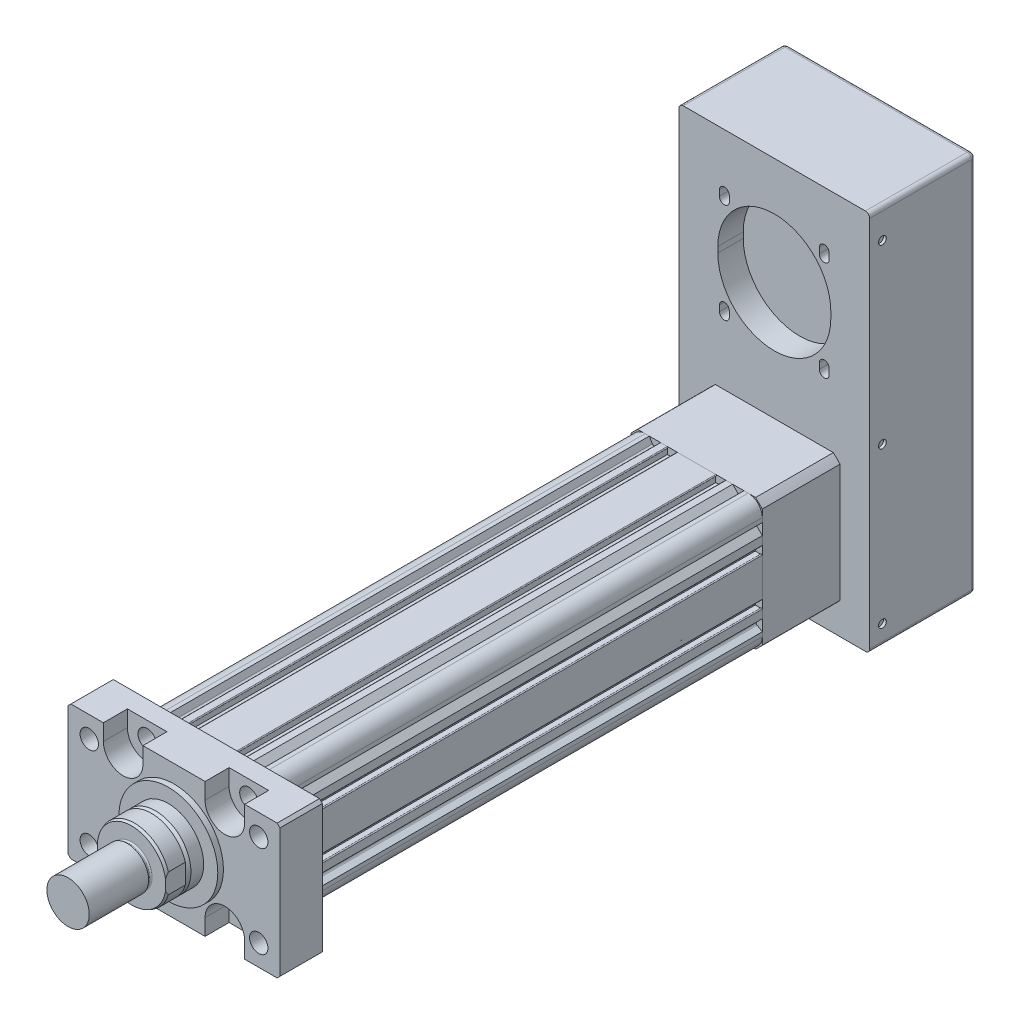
from build123d import *
from OCP.BRepFilletAPI import BRepFilletAPI_MakeChamfer

# Parameters (mm, degrees)
SKETCH_1_R          = 40
SKETCH_1_R_2        = 4.35
EXTRUDE_1_DEPTH     = 340
EXTRUDE_1_2_DEPTH   = 30
SKETCH_3_R          = 35
EXTRUDE_2_DEPTH     = 4
SKETCH_3_3_R        = 6.5
CUT_EXTRUDE_1_DEPTH = 30
SKETCH_3_4_R        = 6.5
CUT_EXTRUDE_2_DEPTH = 17
SKETCH_4_R          = 25
EXTRUDE_3_DEPTH     = 12
CHAMFER_1_SIZE      = 3
CHAMFER_1_SIZE2     = 1.732050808
EXTRUDE_4_DEPTH     = 14
CHAMFER_2_SIZE      = 2
CHAMFER_2_SIZE2     = 0.727940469
SKETCH_6_R          = 13.5
EXTRUDE_5_DEPTH     = 3
SKETCH_7_R          = 15
EXTRUDE_6_DEPTH     = 42
FILLET_1_R          = 1
EXTRUDE_7_DEPTH     = 55
SKETCH_12_W         = 135
SKETCH_12_H         = 270
EXTRUDE_9_DEPTH     = 75
CUT_EXTRUDE_5_DEPTH = 18
CUT_EXTRUDE_6_DEPTH = 18
CUT_EXTRUDE_START   = -11.5
CUT_EXTRUDE_7_DEPTH = 6.5
SKETCH_14_R         = 2.75
CUT_EXTRUDE_8_DEPTH = 2
SKETCH_15_R         = 2.75
CUT_EXTRUDE_9_DEPTH = 2
FILLET_2_R          = 3


with BuildPart() as part:
    # Sketch 1 → Extrude 1 (new body)
    with BuildSketch(Plane.XY):
        with BuildLine():
            Line((46.5, -36.5), (46.5, -33.5))
            Line((46.5, -33.5), (42.782554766, -31.353731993))
            ThreePointArc((42.782554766, -31.353731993), (42.192820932, -30.47113294), (42.534026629, -29.465973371))
            Line((42.534026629, -29.465973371), (46.5, -25.5))
            Line((46.5, -25.5), (46.5, -19.6))
            ThreePointArc((46.5, -19.6), (46.353553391, -19.246446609), (46, -19.1))
            ThreePointArc((46, -19.1), (45.646446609, -19.246446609), (45.5, -19.6))
            Line((45.5, -19.6), (41.5, -19.6))
            Line((41.5, -19.6), (41.5, -13.5))
            Line((41.5, -13.5), (45.5, -13.5))
            ThreePointArc((45.5, -13.5), (45.646446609, -13.853553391), (46, -14))
            ThreePointArc((46, -14), (46.353553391, -13.853553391), (46.5, -13.5))
            Line((46.5, -13.5), (46.5, 13.5))
            ThreePointArc((46.5, 13.5), (46.353553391, 13.853553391), (46, 14))
            ThreePointArc((46, 14), (45.646446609, 13.853553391), (45.5, 13.5))
            Line((45.5, 13.5), (41.5, 13.5))
            Line((41.5, 13.5), (41.5, 19.6))
            Line((41.5, 19.6), (45.5, 19.6))
            ThreePointArc((45.5, 19.6), (45.646446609, 19.246446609), (46, 19.1))
            ThreePointArc((46, 19.1), (46.353553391, 19.246446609), (46.5, 19.6))
            Line((46.5, 19.6), (46.5, 25.5))
            Line((46.5, 25.5), (42.534026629, 29.465973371))
            ThreePointArc((42.534026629, 29.465973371), (42.192820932, 30.47113294), (42.782554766, 31.353731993))
            Line((42.782554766, 31.353731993), (46.5, 33.5))
            Line((46.5, 33.5), (46.5, 36.5))
            ThreePointArc((46.5, 36.5), (43.571067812, 43.571067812), (36.5, 46.5))
            Line((36.5, 46.5), (33.5, 46.5))
            Line((33.5, 46.5), (31.353731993, 42.782554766))
            ThreePointArc((31.353731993, 42.782554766), (30.47113294, 42.192820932), (29.465973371, 42.534026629))
            Line((29.465973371, 42.534026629), (25.5, 46.5))
            Line((25.5, 46.5), (20.8, 46.5))
            ThreePointArc((20.8, 46.5), (20.446446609, 46.353553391), (20.3, 46))
            ThreePointArc((20.3, 46), (20.446446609, 45.646446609), (20.8, 45.5))
            Line((20.8, 45.5), (20.8, 41.5))
            Line((20.8, 41.5), (13.5, 41.5))
            Line((13.5, 41.5), (13.5, 45.5))
            ThreePointArc((13.5, 45.5), (13.853553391, 45.646446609), (14, 46))
            ThreePointArc((14, 46), (13.853553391, 46.353553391), (13.5, 46.5))
            Line((13.5, 46.5), (-13.5, 46.5))
            ThreePointArc((-13.5, 46.5), (-13.853553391, 46.353553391), (-14, 46))
            ThreePointArc((-14, 46), (-13.853553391, 45.646446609), (-13.5, 45.5))
            Line((-13.5, 45.5), (-13.5, 41.5))
            Line((-13.5, 41.5), (-20.8, 41.5))
            Line((-20.8, 41.5), (-20.8, 45.5))
            ThreePointArc((-20.8, 45.5), (-20.446446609, 45.646446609), (-20.3, 46))
            ThreePointArc((-20.3, 46), (-20.446446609, 46.353553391), (-20.8, 46.5))
            Line((-20.8, 46.5), (-25.5, 46.5))
            Line((-25.5, 46.5), (-29.465973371, 42.534026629))
            ThreePointArc((-29.465973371, 42.534026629), (-30.47113294, 42.192820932), (-31.353731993, 42.782554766))
            Line((-31.353731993, 42.782554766), (-33.5, 46.5))
            Line((-33.5, 46.5), (-36.5, 46.5))
            ThreePointArc((-36.5, 46.5), (-43.571067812, 43.571067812), (-46.5, 36.5))
            Line((-46.5, 36.5), (-46.5, 33.5))
            Line((-46.5, 33.5), (-42.782554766, 31.353731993))
            ThreePointArc((-42.782554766, 31.353731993), (-42.192820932, 30.47113294), (-42.534026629, 29.465973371))
            Line((-42.534026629, 29.465973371), (-46.5, 25.5))
            Line((-46.5, 25.5), (-46.5, 20))
            ThreePointArc((-46.5, 20), (-46.353553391, 19.646446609), (-46, 19.5))
            ThreePointArc((-46, 19.5), (-45.646446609, 19.646446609), (-45.5, 20))
            Line((-45.5, 20), (-41.5, 20))
            Line((-41.5, 20), (-41.5, 13.9))
            Line((-41.5, 13.9), (-45.5, 13.9))
            ThreePointArc((-45.5, 13.9), (-45.646446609, 14.253553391), (-46, 14.4))
            ThreePointArc((-46, 14.4), (-46.353553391, 14.253553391), (-46.5, 13.9))
            Line((-46.5, 13.9), (-46.5, -13.9))
            ThreePointArc((-46.5, -13.9), (-46.353553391, -14.253553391), (-46, -14.4))
            ThreePointArc((-46, -14.4), (-45.646446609, -14.253553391), (-45.5, -13.9))
            Line((-45.5, -13.9), (-41.5, -13.9))
            Line((-41.5, -13.9), (-41.5, -20))
            Line((-41.5, -20), (-45.5, -20))
            ThreePointArc((-45.5, -20), (-45.646446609, -19.646446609), (-46, -19.5))
            ThreePointArc((-46, -19.5), (-46.353553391, -19.646446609), (-46.5, -20))
            Line((-46.5, -20), (-46.5, -25.5))
            Line((-46.5, -25.5), (-42.534026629, -29.465973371))
            ThreePointArc((-42.534026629, -29.465973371), (-42.192820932, -30.47113294), (-42.782554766, -31.353731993))
            Line((-42.782554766, -31.353731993), (-46.5, -33.5))
            Line((-46.5, -33.5), (-46.5, -36.5))
            ThreePointArc((-46.5, -36.5), (-43.571067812, -43.571067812), (-36.5, -46.5))
            Line((-36.5, -46.5), (-33.5, -46.5))
            Line((-33.5, -46.5), (-31.353731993, -42.782554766))
            ThreePointArc((-31.353731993, -42.782554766), (-30.47113294, -42.192820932), (-29.465973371, -42.534026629))
            Line((-29.465973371, -42.534026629), (-25.5, -46.5))
            Line((-25.5, -46.5), (25.5, -46.5))
            Line((25.5, -46.5), (29.465973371, -42.534026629))
            ThreePointArc((29.465973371, -42.534026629), (30.47113294, -42.192820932), (31.353731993, -42.782554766))
            Line((31.353731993, -42.782554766), (33.5, -46.5))
            Line((33.5, -46.5), (36.5, -46.5))
            ThreePointArc((36.5, -46.5), (43.571067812, -43.571067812), (46.5, -36.5))
        make_face()
        Circle(SKETCH_1_R, mode=Mode.SUBTRACT)
        with Locations((36, -36)):
            Circle(SKETCH_1_R_2, mode=Mode.SUBTRACT)
        with Locations((-36, -36)):
            Circle(SKETCH_1_R_2, mode=Mode.SUBTRACT)
        with Locations((36, 36)):
            Circle(SKETCH_1_R_2, mode=Mode.SUBTRACT)
        with Locations((-36, 36)):
            Circle(SKETCH_1_R_2, mode=Mode.SUBTRACT)
        with BuildLine():
            Line((25.75, -42.5), (11.324751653, -42.5))
            ThreePointArc((11.324751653, -42.5), (10.829080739, -42.065653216), (11.194582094, -41.517241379))
            ThreePointArc((11.194582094, -41.517241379), (18.919894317, -38.613956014), (25.948275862, -34.288292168))
            ThreePointArc((25.948275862, -34.288292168), (26.472640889, -34.239297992), (26.75, -34.68699324))
            Line((26.75, -34.68699324), (26.75, -41.5))
            Line((26.75, -41.5), (25.75, -42.5))
        make_face(mode=Mode.SUBTRACT)
        with BuildLine():
            Line((-25.75, -42.5), (-11.324751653, -42.5))
            ThreePointArc((-11.324751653, -42.5), (-10.829080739, -42.065653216), (-11.194582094, -41.517241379))
            ThreePointArc((-11.194582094, -41.517241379), (-18.919894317, -38.613956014), (-25.948275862, -34.288292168))
            ThreePointArc((-25.948275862, -34.288292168), (-26.472640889, -34.239297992), (-26.75, -34.68699324))
            Line((-26.75, -34.68699324), (-26.75, -41.5))
            Line((-26.75, -41.5), (-25.75, -42.5))
        make_face(mode=Mode.SUBTRACT)
        with BuildLine():
            Line((26.312283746, 40), (20.798294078, 40))
            ThreePointArc((20.798294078, 40), (20.548294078, 39.933012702), (20.365281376, 39.75))
            Line((20.365281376, 39.75), (19.794336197, 38.761093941))
            ThreePointArc((19.794336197, 38.761093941), (19.747068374, 38.372059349), (19.994850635, 38.068437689))
            ThreePointArc((19.994850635, 38.068437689), (22.57372353, 36.598183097), (25.045011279, 34.953503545))
            ThreePointArc((25.045011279, 34.953503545), (25.441798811, 34.871210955), (25.769245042, 35.109939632))
            Line((25.769245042, 35.109939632), (27.64187192, 38.353424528))
            ThreePointArc((27.64187192, 38.353424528), (27.704581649, 38.668687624), (27.562412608, 38.956977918))
            Line((27.562412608, 38.956977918), (26.665837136, 39.853553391))
            ThreePointArc((26.665837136, 39.853553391), (26.503625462, 39.961939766), (26.312283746, 40))
        make_face(mode=Mode.SUBTRACT)
        with BuildLine():
            Line((38.956977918, 27.562412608), (39.853553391, 26.665837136))
            ThreePointArc((39.853553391, 26.665837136), (39.961939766, 26.503625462), (40, 26.312283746))
            Line((40, 26.312283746), (40, 20.798294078))
            ThreePointArc((40, 20.798294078), (39.933012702, 20.548294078), (39.75, 20.365281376))
            Line((39.75, 20.365281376), (38.761093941, 19.794336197))
            ThreePointArc((38.761093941, 19.794336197), (38.372059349, 19.747068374), (38.068437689, 19.994850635))
            ThreePointArc((38.068437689, 19.994850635), (36.598183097, 22.57372353), (34.953503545, 25.045011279))
            ThreePointArc((34.953503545, 25.045011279), (34.871210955, 25.441798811), (35.109939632, 25.769245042))
            Line((35.109939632, 25.769245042), (38.353424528, 27.64187192))
            ThreePointArc((38.353424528, 27.64187192), (38.668687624, 27.704581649), (38.956977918, 27.562412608))
        make_face(mode=Mode.SUBTRACT)
        with BuildLine():
            Line((38.956977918, -27.562412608), (39.853553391, -26.665837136))
            ThreePointArc((39.853553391, -26.665837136), (39.961939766, -26.503625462), (40, -26.312283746))
            Line((40, -26.312283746), (40, -20.798294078))
            ThreePointArc((40, -20.798294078), (39.933012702, -20.548294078), (39.75, -20.365281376))
            Line((39.75, -20.365281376), (38.761093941, -19.794336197))
            ThreePointArc((38.761093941, -19.794336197), (38.372059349, -19.747068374), (38.068437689, -19.994850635))
            ThreePointArc((38.068437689, -19.994850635), (36.598183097, -22.57372353), (34.953503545, -25.045011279))
            ThreePointArc((34.953503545, -25.045011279), (34.871210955, -25.441798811), (35.109939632, -25.769245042))
            Line((35.109939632, -25.769245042), (38.353424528, -27.64187192))
            ThreePointArc((38.353424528, -27.64187192), (38.668687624, -27.704581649), (38.956977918, -27.562412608))
        make_face(mode=Mode.SUBTRACT)
        with BuildLine():
            Line((-39.75, -20.365281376), (-38.761093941, -19.794336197))
            ThreePointArc((-38.761093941, -19.794336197), (-38.372059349, -19.747068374), (-38.068437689, -19.994850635))
            ThreePointArc((-38.068437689, -19.994850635), (-36.598183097, -22.57372353), (-34.953503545, -25.045011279))
            ThreePointArc((-34.953503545, -25.045011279), (-34.871210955, -25.441798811), (-35.109939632, -25.769245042))
            Line((-35.109939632, -25.769245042), (-38.353424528, -27.64187192))
            ThreePointArc((-38.353424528, -27.64187192), (-38.668687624, -27.704581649), (-38.956977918, -27.562412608))
            Line((-38.956977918, -27.562412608), (-39.853553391, -26.665837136))
            ThreePointArc((-39.853553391, -26.665837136), (-39.961939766, -26.503625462), (-40, -26.312283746))
            Line((-40, -26.312283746), (-40, -20.798294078))
            ThreePointArc((-40, -20.798294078), (-39.933012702, -20.548294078), (-39.75, -20.365281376))
        make_face(mode=Mode.SUBTRACT)
        with BuildLine():
            Line((-20.365281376, 39.75), (-19.794336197, 38.761093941))
            ThreePointArc((-19.794336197, 38.761093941), (-19.747068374, 38.372059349), (-19.994850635, 38.068437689))
            ThreePointArc((-19.994850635, 38.068437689), (-22.57372353, 36.598183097), (-25.045011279, 34.953503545))
            ThreePointArc((-25.045011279, 34.953503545), (-25.441798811, 34.871210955), (-25.769245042, 35.109939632))
            Line((-25.769245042, 35.109939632), (-27.64187192, 38.353424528))
            ThreePointArc((-27.64187192, 38.353424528), (-27.704581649, 38.668687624), (-27.562412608, 38.956977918))
            Line((-27.562412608, 38.956977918), (-26.665837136, 39.853553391))
            ThreePointArc((-26.665837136, 39.853553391), (-26.503625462, 39.961939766), (-26.312283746, 40))
            Line((-26.312283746, 40), (-20.798294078, 40))
            ThreePointArc((-20.798294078, 40), (-20.548294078, 39.933012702), (-20.365281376, 39.75))
        make_face(mode=Mode.SUBTRACT)
        with BuildLine():
            Line((-38.956977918, 27.562412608), (-39.853553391, 26.665837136))
            ThreePointArc((-39.853553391, 26.665837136), (-39.961939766, 26.503625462), (-40, 26.312283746))
            Line((-40, 26.312283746), (-40, 20.798294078))
            ThreePointArc((-40, 20.798294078), (-39.933012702, 20.548294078), (-39.75, 20.365281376))
            Line((-39.75, 20.365281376), (-38.761093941, 19.794336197))
            ThreePointArc((-38.761093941, 19.794336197), (-38.372059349, 19.747068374), (-38.068437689, 19.994850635))
            ThreePointArc((-38.068437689, 19.994850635), (-36.598183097, 22.57372353), (-34.953503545, 25.045011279))
            ThreePointArc((-34.953503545, 25.045011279), (-34.871210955, 25.441798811), (-35.109939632, 25.769245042))
            Line((-35.109939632, 25.769245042), (-38.353424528, 27.64187192))
            ThreePointArc((-38.353424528, 27.64187192), (-38.668687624, 27.704581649), (-38.956977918, 27.562412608))
        make_face(mode=Mode.SUBTRACT)
    extrude(amount=EXTRUDE_1_DEPTH)

    # Sketch 2 → Extrude 1 2 (add)
    with BuildSketch(Plane.XY.offset(340)):
        Polygon((-75, 45.5), (-73, 47.5), (73, 47.5), (75, 45.5), (75, -45.5), (73, -47.5), (-73, -47.5), (-75, -45.5), align=None)
    extrude(amount=EXTRUDE_1_2_DEPTH)

    # Sketch 3 → Extrude 2 (add)
    with BuildSketch(Plane.XY.offset(370)):
        Circle(SKETCH_3_R)
    extrude(amount=EXTRUDE_2_DEPTH)

    # Sketch 3_3 → Cut-Extrude 1 (cut)
    with BuildSketch(Plane.XY.offset(370)):
        with Locations((-36, 36)):
            Circle(SKETCH_3_3_R)
        with Locations((36, 36)):
            Circle(SKETCH_3_3_R)
        with Locations((60, 32.5)):
            Circle(SKETCH_3_3_R)
        with Locations((36, -36)):
            Circle(SKETCH_3_3_R)
        with Locations((-36, -36)):
            Circle(SKETCH_3_3_R)
        with Locations((-60, -32.5)):
            Circle(SKETCH_3_3_R)
        with Locations((-60, 32.5)):
            Circle(SKETCH_3_3_R)
        with Locations((60, -32.5)):
            Circle(SKETCH_3_3_R)
    extrude(amount=-CUT_EXTRUDE_1_DEPTH, mode=Mode.SUBTRACT)

    # Sketch 3_4 → Cut-Extrude 2 (cut)
    # profile 1 of 4: a face of its own
    with BuildSketch(Plane.XY.offset(370)):
        with BuildLine():
            Line((50, 47.5), (22, 47.5))
            Line((22, 47.5), (22, 36))
            ThreePointArc((22, 36), (36, 22), (50, 36))
            Line((50, 36), (50, 47.5))
        make_face()
        with Locations((36, 36)):
            Circle(SKETCH_3_4_R, mode=Mode.SUBTRACT)
    # profile 2 of 4: a face of its own
    with BuildSketch(Plane.XY.offset(370)):
        with BuildLine():
            Line((50, -47.5), (50, -36))
            ThreePointArc((50, -36), (36, -22), (22, -36))
            Line((22, -36), (22, -47.5))
            Line((22, -47.5), (50, -47.5))
        make_face()
        with Locations((36, -36)):
            Circle(SKETCH_3_4_R, mode=Mode.SUBTRACT)
    # profile 3 of 4: a face of its own
    with BuildSketch(Plane.XY.offset(370)):
        with BuildLine():
            Line((-50, -47.5), (-22, -47.5))
            Line((-22, -47.5), (-22, -36))
            ThreePointArc((-22, -36), (-36, -22), (-50, -36))
            Line((-50, -36), (-50, -47.5))
        make_face()
        with Locations((-36, -36)):
            Circle(SKETCH_3_4_R, mode=Mode.SUBTRACT)
    # profile 4 of 4: a face of its own
    with BuildSketch(Plane.XY.offset(370)):
        with BuildLine():
            Line((-50, 36), (-50, 47.5))
            Line((-50, 47.5), (-22, 47.5))
            Line((-22, 47.5), (-22, 36))
            ThreePointArc((-22, 36), (-36, 22), (-50, 36))
        make_face()
    extrude(amount=-CUT_EXTRUDE_2_DEPTH, mode=Mode.SUBTRACT)

    # Sketch 4 → Extrude 3 (add)
    with BuildSketch(Plane.XY.offset(374)):
        Circle(SKETCH_4_R)
    extrude(amount=EXTRUDE_3_DEPTH)

    # Chamfer 1
    chamfer_1_edges = [part.edges().sort_by_distance(p)[0] for p in [
        (-25, 0, 386),
    ]]
    chamfer_1_side = [part.faces().sort_by_distance(p)[0] for p in [
        (-25, 0, 380),
    ]]
    chamfer(chamfer_1_edges, length=CHAMFER_1_SIZE, length2=CHAMFER_1_SIZE2, reference=chamfer_1_side[0])

    # Sketch 5 → Extrude 4 (add)
    with BuildSketch(Plane.XY.offset(386)):
        with BuildLine():
            Line((-24, 7), (-24, -7))
            ThreePointArc((-24, -7), (0, -25), (24, -7))
            Line((24, -7), (24, 7))
            ThreePointArc((24, 7), (0, 25), (-24, 7))
        make_face()
    extrude(amount=EXTRUDE_4_DEPTH)

    # Chamfer 2: one chamfer whose edges measure the first distance from different faces: ONE call of the kernel's chamfer builder (chamfer() names one face for all edges)
    chamfer_2_edges_1 = [part.edges().sort_by_distance(p)[0] for p in [
        (0, 25, 400),
    ]]
    chamfer_2_side_1 = [part.faces().sort_by_distance(p)[0] for p in [
        (0, 25, 393),
    ]]
    chamfer_2_edges_2 = [part.edges().sort_by_distance(p)[0] for p in [
        (0, -25, 400),
    ]]
    chamfer_2_side_2 = [part.faces().sort_by_distance(p)[0] for p in [
        (0, -25, 393),
    ]]
    chamfer_2 = BRepFilletAPI_MakeChamfer(part.part.solid().wrapped)
    for e in chamfer_2_edges_1:
        chamfer_2.Add(CHAMFER_2_SIZE, CHAMFER_2_SIZE2, e.wrapped, chamfer_2_side_1[0].wrapped)  # the first distance lies on this face
    for e in chamfer_2_edges_2:
        chamfer_2.Add(CHAMFER_2_SIZE, CHAMFER_2_SIZE2, e.wrapped, chamfer_2_side_2[0].wrapped)  # the first distance lies on this face
    add(Compound.cast(chamfer_2.Shape()), mode=Mode.REPLACE)

    # Sketch 6 → Extrude 5 (add)
    with BuildSketch(Plane.XY.offset(400)):
        Circle(SKETCH_6_R)
    extrude(amount=EXTRUDE_5_DEPTH)

    # Sketch 7 → Extrude 6 (add)
    with BuildSketch(Plane.XY.offset(403)):
        with Locations(Location((0, 0, 0), (0, 0, 180))):
            Circle(SKETCH_7_R)
    extrude(amount=EXTRUDE_6_DEPTH)

    # Fillet 1
    fillet_1_edges = [part.edges().sort_by_distance(p)[0] for p in [
        (-13.5, 0, 400),
    ]]
    fillet(fillet_1_edges, radius=FILLET_1_R)


with BuildPart() as body_2:
    # Sketch 8 → Extrude 7 (new body)
    with BuildSketch(Plane(origin=(0, 0, 0), x_dir=(-1, 0, 0), z_dir=(0, 0, -1))):
        with BuildLine():
            Line((-41.761226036, 46.5), (41.761226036, 46.5))
            ThreePointArc((41.761226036, 46.5), (44.194173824, 44.194173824), (46.5, 41.761226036))
            Line((46.5, 41.761226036), (46.5, -41.761226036))
            ThreePointArc((46.5, -41.761226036), (44.194173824, -44.194173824), (41.761226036, -46.5))
            Line((41.761226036, -46.5), (-41.761226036, -46.5))
            ThreePointArc((-41.761226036, -46.5), (-44.194173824, -44.194173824), (-46.5, -41.761226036))
            Line((-46.5, -41.761226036), (-46.5, 41.761226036))
            ThreePointArc((-46.5, 41.761226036), (-44.194173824, 44.194173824), (-41.761226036, 46.5))
        make_face()
    extrude(amount=EXTRUDE_7_DEPTH)

    # Sketch 12 → Extrude 9 (add)
    with BuildSketch(Plane(origin=(0, 0, -55), x_dir=(-1, 0, 0), z_dir=(0, 0, -1))):
        with Locations((0, 71)):
            Rectangle(SKETCH_12_W, SKETCH_12_H)
    extrude(amount=EXTRUDE_9_DEPTH)

    # Sketch 13 → Cut-Extrude 5 (cut)
    with BuildSketch(Plane.XY.offset(-55)):
        with BuildLine():
            Line((-40, 132), (-40, 128))
            ThreePointArc((-40, 128), (0, 88), (40, 128))
            Line((40, 128), (40, 132))
            ThreePointArc((40, 132), (0, 172), (-40, 132))
        make_face()
    extrude(amount=-CUT_EXTRUDE_5_DEPTH, mode=Mode.SUBTRACT)

    # Sketch 13_3 → Cut-Extrude 6 (cut)
    with BuildSketch(Plane.XY.offset(-55)):
        with BuildLine():
            ThreePointArc((31.855339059, 167.355339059), (35.355339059, 170.855339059), (38.855339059, 167.355339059))
            Line((38.855339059, 167.355339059), (38.855339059, 163.355339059))
            ThreePointArc((38.855339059, 163.355339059), (35.355339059, 159.855339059), (31.855339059, 163.355339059))
            Line((31.855339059, 163.355339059), (31.855339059, 167.355339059))
        make_face()
        with BuildLine():
            ThreePointArc((-31.855339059, 92.644660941), (-35.355339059, 89.144660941), (-38.855339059, 92.644660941))
            Line((-38.855339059, 92.644660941), (-38.855339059, 96.644660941))
            ThreePointArc((-38.855339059, 96.644660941), (-35.355339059, 100.144660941), (-31.855339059, 96.644660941))
            Line((-31.855339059, 96.644660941), (-31.855339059, 92.644660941))
        make_face()
        with BuildLine():
            ThreePointArc((-31.855339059, 167.355339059), (-35.355339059, 170.855339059), (-38.855339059, 167.355339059))
            Line((-38.855339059, 167.355339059), (-38.855339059, 163.355339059))
            ThreePointArc((-38.855339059, 163.355339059), (-35.355339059, 159.855339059), (-31.855339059, 163.355339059))
            Line((-31.855339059, 163.355339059), (-31.855339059, 167.355339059))
        make_face()
        with BuildLine():
            ThreePointArc((38.855339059, 96.644660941), (35.355339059, 100.144660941), (31.855339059, 96.644660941))
            Line((31.855339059, 96.644660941), (31.855339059, 92.644660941))
            ThreePointArc((31.855339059, 92.644660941), (35.355339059, 89.144660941), (38.855339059, 92.644660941))
            Line((38.855339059, 92.644660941), (38.855339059, 96.644660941))
        make_face()
    extrude(amount=-CUT_EXTRUDE_6_DEPTH, mode=Mode.SUBTRACT)

    # Sketch 13_4 → Cut-Extrude 7 (cut)
    with BuildSketch(Plane.XY.offset(-55).offset(CUT_EXTRUDE_START)):
        with BuildLine():
            Line((-40.555339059, 163.305339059), (-40.555339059, 167.405339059))
            ThreePointArc((-40.555339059, 167.405339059), (-35.355339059, 172.605339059), (-30.155339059, 167.405339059))
            Line((-30.155339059, 167.405339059), (-30.155339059, 163.305339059))
            ThreePointArc((-30.155339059, 163.305339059), (-35.355339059, 158.105339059), (-40.555339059, 163.305339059))
        make_face()
        with BuildLine():
            Line((40.555339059, 163.305339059), (40.555339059, 167.405339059))
            ThreePointArc((40.555339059, 167.405339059), (35.355339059, 172.605339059), (30.155339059, 167.405339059))
            Line((30.155339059, 167.405339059), (30.155339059, 163.305339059))
            ThreePointArc((30.155339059, 163.305339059), (35.355339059, 158.105339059), (40.555339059, 163.305339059))
        make_face()
        with BuildLine():
            Line((40.555339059, 96.694660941), (40.555339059, 92.594660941))
            ThreePointArc((40.555339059, 92.594660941), (35.355339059, 87.394660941), (30.155339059, 92.594660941))
            Line((30.155339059, 92.594660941), (30.155339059, 96.694660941))
            ThreePointArc((30.155339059, 96.694660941), (35.355339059, 101.894660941), (40.555339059, 96.694660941))
        make_face()
        with BuildLine():
            Line((-40.555339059, 96.694660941), (-40.555339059, 92.594660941))
            ThreePointArc((-40.555339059, 92.594660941), (-35.355339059, 87.394660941), (-30.155339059, 92.594660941))
            Line((-30.155339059, 92.594660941), (-30.155339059, 96.694660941))
            ThreePointArc((-30.155339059, 96.694660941), (-35.355339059, 101.894660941), (-40.555339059, 96.694660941))
        make_face()
    extrude(amount=-CUT_EXTRUDE_7_DEPTH, mode=Mode.SUBTRACT)

    # Sketch 14 → Cut-Extrude 8 (cut)
    with BuildSketch(Plane.ZY.offset(67.5)):
        with Locations(Location((-64, -50, 0), (0, 0, 270))):
            Circle(SKETCH_14_R)
        with Locations(Location((-64, 60, 0), (0, 0, 270))):
            Circle(SKETCH_14_R)
        with Locations(Location((-64, 185, 0), (0, 0, 270))):
            Circle(SKETCH_14_R)
    extrude(amount=-CUT_EXTRUDE_8_DEPTH, mode=Mode.SUBTRACT)

    # Sketch 15 → Cut-Extrude 9 (cut)
    with BuildSketch(Plane(origin=(67.5, 0, 0), x_dir=(0, 0, -1), z_dir=(1, 0, 0))):
        with Locations(Location((64, -50, 0), (0, 0, 270))):
            Circle(SKETCH_15_R)
        with Locations(Location((64, 60, 0), (0, 0, 270))):
            Circle(SKETCH_15_R)
        with Locations(Location((64, 185, 0), (0, 0, 270))):
            Circle(SKETCH_15_R)
    extrude(amount=-CUT_EXTRUDE_9_DEPTH, mode=Mode.SUBTRACT)

    # Fillet 2
    fillet_2_edges = [body_2.edges().sort_by_distance(p)[0] for p in [
        (-67.5, -64, -92.5),
        (-67.5, 206, -92.5),
        (67.5, 206, -92.5),
        (67.5, -64, -92.5),
        (-67.5, 71, -130),
        (0, 206, -130),
        (67.5, 71, -130),
        (0, -64, -130),
    ]]
    fillet(fillet_2_edges, radius=FILLET_2_R)


solid = Compound([part.part, body_2.part])
